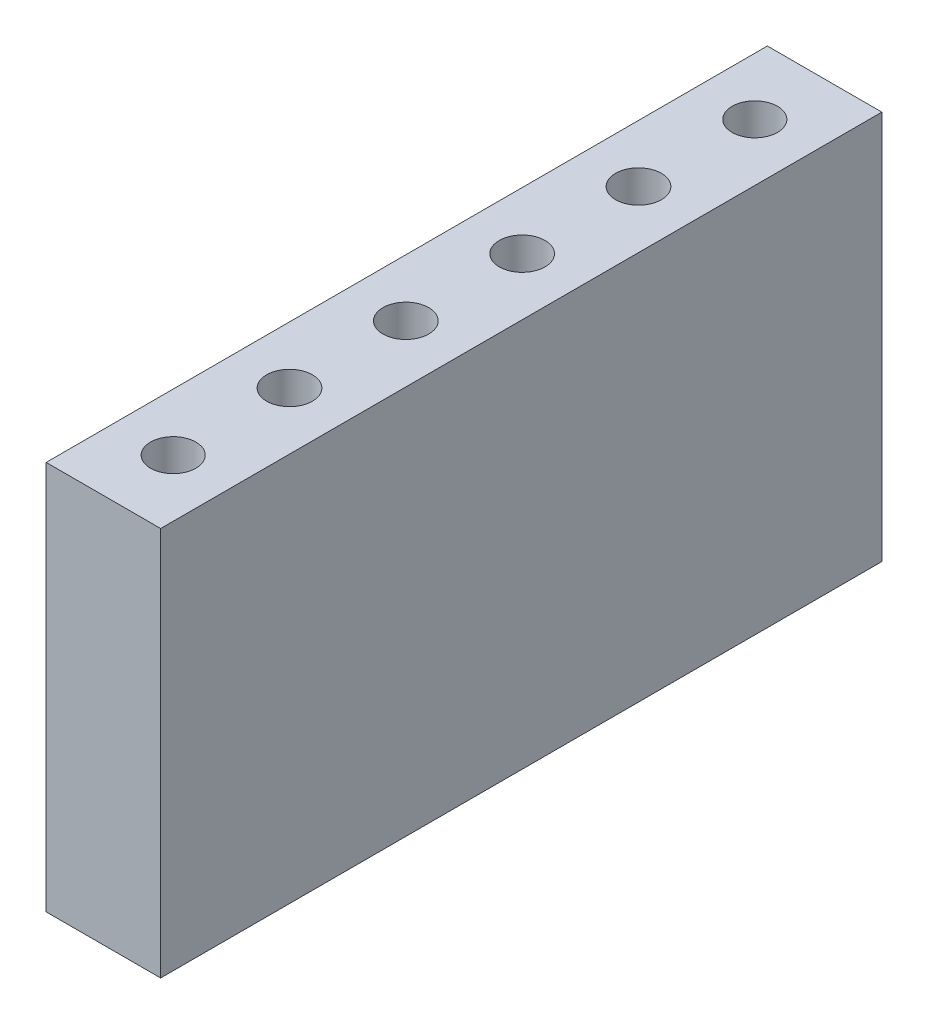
ISO-10303-21;
HEADER;
FILE_DESCRIPTION(('STEP AP214'),'2;1');
FILE_NAME('part.step','',(''),(''),'','','');
FILE_SCHEMA(('AUTOMOTIVE_DESIGN { 1 0 10303 214 1 1 1 1 }'));
ENDSEC;
DATA;
#1=APPLICATION_CONTEXT('core data for automotive mechanical design processes');
#2=APPLICATION_PROTOCOL_DEFINITION('international standard','automotive_design',2000,#1);
#3=PRODUCT_CONTEXT('',#1,'mechanical');
#4=PRODUCT('Part','Part','',(#3));
#5=PRODUCT_RELATED_PRODUCT_CATEGORY('part','',(#4));
#6=PRODUCT_DEFINITION_FORMATION('','',#4);
#7=PRODUCT_DEFINITION_CONTEXT('part definition',#1,'design');
#8=PRODUCT_DEFINITION('design','',#6,#7);
#9=PRODUCT_DEFINITION_SHAPE('','',#8);
#10=(LENGTH_UNIT() NAMED_UNIT(*) SI_UNIT(.MILLI.,.METRE.));
#11=(NAMED_UNIT(*) PLANE_ANGLE_UNIT() SI_UNIT($,.RADIAN.));
#12=(NAMED_UNIT(*) SI_UNIT($,.STERADIAN.) SOLID_ANGLE_UNIT());
#13=UNCERTAINTY_MEASURE_WITH_UNIT(LENGTH_MEASURE(1.E-05),#10,'distance_accuracy_value','');
#14=(GEOMETRIC_REPRESENTATION_CONTEXT(3) GLOBAL_UNCERTAINTY_ASSIGNED_CONTEXT((#13)) GLOBAL_UNIT_ASSIGNED_CONTEXT((#10,
#11,#12)) REPRESENTATION_CONTEXT('',''));
#15=CARTESIAN_POINT('',(0.,0.,0.));
#16=DIRECTION('',(0.,0.,1.));
#17=DIRECTION('',(1.,0.,0.));
#18=AXIS2_PLACEMENT_3D('',#15,#16,#17);
#19=CARTESIAN_POINT('',(0.,8.5,0.));
#20=DIRECTION('',(1.,0.,0.));
#21=DIRECTION('',(0.,0.,-1.));
#22=AXIS2_PLACEMENT_3D('',#19,#20,#21);
#23=PLANE('',#22);
#24=DIRECTION('',(0.,0.,1.));
#25=VECTOR('',#24,1.);
#26=CARTESIAN_POINT('',(0.,0.,0.));
#27=LINE('',#26,#25);
#28=CARTESIAN_POINT('',(0.,0.,-15.748));
#29=VERTEX_POINT('',#28);
#30=CARTESIAN_POINT('',(0.,0.,0.));
#31=VERTEX_POINT('',#30);
#32=EDGE_CURVE('E94',#29,#31,#27,.T.);
#33=ORIENTED_EDGE('',*,*,#32,.T.);
#34=DIRECTION('',(0.,-1.,0.));
#35=VECTOR('',#34,1.);
#36=CARTESIAN_POINT('',(0.,8.5,0.));
#37=LINE('',#36,#35);
#38=CARTESIAN_POINT('',(0.,8.5,0.));
#39=VERTEX_POINT('',#38);
#40=EDGE_CURVE('E11',#39,#31,#37,.T.);
#41=ORIENTED_EDGE('',*,*,#40,.F.);
#42=DIRECTION('',(0.,0.,1.));
#43=VECTOR('',#42,1.);
#44=CARTESIAN_POINT('',(0.,8.5,0.));
#45=LINE('',#44,#43);
#46=CARTESIAN_POINT('',(0.,8.5,-15.748));
#47=VERTEX_POINT('',#46);
#48=EDGE_CURVE('E82',#47,#39,#45,.T.);
#49=ORIENTED_EDGE('',*,*,#48,.F.);
#50=DIRECTION('',(0.,-1.,0.));
#51=VECTOR('',#50,1.);
#52=CARTESIAN_POINT('',(0.,8.5,-15.748));
#53=LINE('',#52,#51);
#54=EDGE_CURVE('E90',#47,#29,#53,.T.);
#55=ORIENTED_EDGE('',*,*,#54,.T.);
#56=EDGE_LOOP('',(#33,#41,#49,#55));
#57=FACE_BOUND('',#56,.T.);
#58=ADVANCED_FACE('F31',(#57),#23,.F.);
#59=CARTESIAN_POINT('',(0.,8.5,0.));
#60=DIRECTION('',(0.,0.,-1.));
#61=DIRECTION('',(-1.,0.,0.));
#62=AXIS2_PLACEMENT_3D('',#59,#60,#61);
#63=PLANE('',#62);
#64=DIRECTION('',(1.,0.,0.));
#65=VECTOR('',#64,1.);
#66=CARTESIAN_POINT('',(0.,0.,0.));
#67=LINE('',#66,#65);
#68=CARTESIAN_POINT('',(2.5,0.,0.));
#69=VERTEX_POINT('',#68);
#70=EDGE_CURVE('E86',#31,#69,#67,.T.);
#71=ORIENTED_EDGE('',*,*,#70,.T.);
#72=DIRECTION('',(0.,-1.,0.));
#73=VECTOR('',#72,1.);
#74=CARTESIAN_POINT('',(2.5,8.5,0.));
#75=LINE('',#74,#73);
#76=CARTESIAN_POINT('',(2.5,8.5,0.));
#77=VERTEX_POINT('',#76);
#78=EDGE_CURVE('E39',#77,#69,#75,.T.);
#79=ORIENTED_EDGE('',*,*,#78,.F.);
#80=DIRECTION('',(1.,0.,0.));
#81=VECTOR('',#80,1.);
#82=CARTESIAN_POINT('',(0.,8.5,0.));
#83=LINE('',#82,#81);
#84=EDGE_CURVE('E77',#39,#77,#83,.T.);
#85=ORIENTED_EDGE('',*,*,#84,.F.);
#86=ORIENTED_EDGE('',*,*,#40,.T.);
#87=EDGE_LOOP('',(#71,#79,#85,#86));
#88=FACE_BOUND('',#87,.T.);
#89=ADVANCED_FACE('F85',(#88),#63,.F.);
#90=CARTESIAN_POINT('',(2.5,8.5,0.));
#91=DIRECTION('',(-1.,0.,0.));
#92=DIRECTION('',(0.,0.,1.));
#93=AXIS2_PLACEMENT_3D('',#90,#91,#92);
#94=PLANE('',#93);
#95=DIRECTION('',(0.,0.,-1.));
#96=VECTOR('',#95,1.);
#97=CARTESIAN_POINT('',(2.5,0.,0.));
#98=LINE('',#97,#96);
#99=CARTESIAN_POINT('',(2.5,0.,-15.748));
#100=VERTEX_POINT('',#99);
#101=EDGE_CURVE('E64',#69,#100,#98,.T.);
#102=ORIENTED_EDGE('',*,*,#101,.T.);
#103=DIRECTION('',(0.,-1.,0.));
#104=VECTOR('',#103,1.);
#105=CARTESIAN_POINT('',(2.5,8.5,-15.748));
#106=LINE('',#105,#104);
#107=CARTESIAN_POINT('',(2.5,8.5,-15.748));
#108=VERTEX_POINT('',#107);
#109=EDGE_CURVE('E87',#108,#100,#106,.T.);
#110=ORIENTED_EDGE('',*,*,#109,.F.);
#111=DIRECTION('',(0.,0.,-1.));
#112=VECTOR('',#111,1.);
#113=CARTESIAN_POINT('',(2.5,8.5,0.));
#114=LINE('',#113,#112);
#115=EDGE_CURVE('E80',#77,#108,#114,.T.);
#116=ORIENTED_EDGE('',*,*,#115,.F.);
#117=ORIENTED_EDGE('',*,*,#78,.T.);
#118=EDGE_LOOP('',(#102,#110,#116,#117));
#119=FACE_BOUND('',#118,.T.);
#120=ADVANCED_FACE('F88',(#119),#94,.F.);
#121=CARTESIAN_POINT('',(0.,8.5,-15.748));
#122=DIRECTION('',(0.,0.,1.));
#123=DIRECTION('',(1.,0.,0.));
#124=AXIS2_PLACEMENT_3D('',#121,#122,#123);
#125=PLANE('',#124);
#126=DIRECTION('',(-1.,0.,0.));
#127=VECTOR('',#126,1.);
#128=CARTESIAN_POINT('',(0.,0.,-15.748));
#129=LINE('',#128,#127);
#130=EDGE_CURVE('E70',#100,#29,#129,.T.);
#131=ORIENTED_EDGE('',*,*,#130,.T.);
#132=ORIENTED_EDGE('',*,*,#54,.F.);
#133=DIRECTION('',(-1.,0.,0.));
#134=VECTOR('',#133,1.);
#135=CARTESIAN_POINT('',(0.,8.5,-15.748));
#136=LINE('',#135,#134);
#137=EDGE_CURVE('E47',#108,#47,#136,.T.);
#138=ORIENTED_EDGE('',*,*,#137,.F.);
#139=ORIENTED_EDGE('',*,*,#109,.T.);
#140=EDGE_LOOP('',(#131,#132,#138,#139));
#141=FACE_BOUND('',#140,.T.);
#142=ADVANCED_FACE('F102',(#141),#125,.F.);
#143=CARTESIAN_POINT('',(0.,8.5,-15.748));
#144=DIRECTION('',(0.,-1.,0.));
#145=DIRECTION('',(0.,0.,-1.));
#146=AXIS2_PLACEMENT_3D('',#143,#144,#145);
#147=PLANE('',#146);
#148=CARTESIAN_POINT('',(1.25,8.5,-9.144));
#149=DIRECTION('',(0.,1.,0.));
#150=DIRECTION('',(0.,0.,-1.));
#151=AXIS2_PLACEMENT_3D('',#148,#149,#150);
#152=CIRCLE('',#151,0.500000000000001);
#153=CARTESIAN_POINT('',(1.25,8.5,-9.644));
#154=VERTEX_POINT('',#153);
#155=EDGE_CURVE('E138',#154,#154,#152,.T.);
#156=ORIENTED_EDGE('',*,*,#155,.F.);
#157=EDGE_LOOP('',(#156));
#158=FACE_BOUND('',#157,.T.);
#159=CARTESIAN_POINT('',(1.25,8.5,-11.684));
#160=DIRECTION('',(0.,1.,0.));
#161=DIRECTION('',(0.,0.,-1.));
#162=AXIS2_PLACEMENT_3D('',#159,#160,#161);
#163=CIRCLE('',#162,0.500000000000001);
#164=CARTESIAN_POINT('',(1.25,8.5,-12.184));
#165=VERTEX_POINT('',#164);
#166=EDGE_CURVE('E132',#165,#165,#163,.T.);
#167=ORIENTED_EDGE('',*,*,#166,.F.);
#168=EDGE_LOOP('',(#167));
#169=FACE_BOUND('',#168,.T.);
#170=CARTESIAN_POINT('',(1.25,8.5,-14.224));
#171=DIRECTION('',(0.,1.,0.));
#172=DIRECTION('',(0.,0.,-1.));
#173=AXIS2_PLACEMENT_3D('',#170,#171,#172);
#174=CIRCLE('',#173,0.4953);
#175=CARTESIAN_POINT('',(1.25,8.5,-14.7193));
#176=VERTEX_POINT('',#175);
#177=EDGE_CURVE('E126',#176,#176,#174,.T.);
#178=ORIENTED_EDGE('',*,*,#177,.F.);
#179=EDGE_LOOP('',(#178));
#180=FACE_BOUND('',#179,.T.);
#181=CARTESIAN_POINT('',(1.25,8.5,-1.524));
#182=DIRECTION('',(0.,1.,0.));
#183=DIRECTION('',(0.,0.,1.));
#184=AXIS2_PLACEMENT_3D('',#181,#182,#183);
#185=CIRCLE('',#184,0.4953);
#186=CARTESIAN_POINT('',(1.25,8.5,-1.0287));
#187=VERTEX_POINT('',#186);
#188=EDGE_CURVE('E120',#187,#187,#185,.T.);
#189=ORIENTED_EDGE('',*,*,#188,.F.);
#190=EDGE_LOOP('',(#189));
#191=FACE_BOUND('',#190,.T.);
#192=CARTESIAN_POINT('',(1.25,8.5,-4.064));
#193=DIRECTION('',(0.,1.,0.));
#194=DIRECTION('',(0.,0.,1.));
#195=AXIS2_PLACEMENT_3D('',#192,#193,#194);
#196=CIRCLE('',#195,0.499999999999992);
#197=CARTESIAN_POINT('',(1.25,8.5,-3.56400000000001));
#198=VERTEX_POINT('',#197);
#199=EDGE_CURVE('E114',#198,#198,#196,.T.);
#200=ORIENTED_EDGE('',*,*,#199,.F.);
#201=EDGE_LOOP('',(#200));
#202=FACE_BOUND('',#201,.T.);
#203=CARTESIAN_POINT('',(1.25,8.5,-6.604));
#204=DIRECTION('',(0.,1.,0.));
#205=DIRECTION('',(0.,0.,1.));
#206=AXIS2_PLACEMENT_3D('',#203,#204,#205);
#207=CIRCLE('',#206,0.500000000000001);
#208=CARTESIAN_POINT('',(1.25,8.5,-6.104));
#209=VERTEX_POINT('',#208);
#210=EDGE_CURVE('E108',#209,#209,#207,.T.);
#211=ORIENTED_EDGE('',*,*,#210,.F.);
#212=EDGE_LOOP('',(#211));
#213=FACE_BOUND('',#212,.T.);
#214=ORIENTED_EDGE('',*,*,#48,.T.);
#215=ORIENTED_EDGE('',*,*,#84,.T.);
#216=ORIENTED_EDGE('',*,*,#115,.T.);
#217=ORIENTED_EDGE('',*,*,#137,.T.);
#218=EDGE_LOOP('',(#214,#215,#216,#217));
#219=FACE_BOUND('',#218,.T.);
#220=ADVANCED_FACE('F78',(#158,#169,#180,#191,#202,#213,#219),#147,.F.);
#221=CARTESIAN_POINT('',(0.,0.,-15.748));
#222=DIRECTION('',(0.,-1.,0.));
#223=DIRECTION('',(0.,0.,-1.));
#224=AXIS2_PLACEMENT_3D('',#221,#222,#223);
#225=PLANE('',#224);
#226=ORIENTED_EDGE('',*,*,#32,.F.);
#227=ORIENTED_EDGE('',*,*,#130,.F.);
#228=ORIENTED_EDGE('',*,*,#101,.F.);
#229=ORIENTED_EDGE('',*,*,#70,.F.);
#230=EDGE_LOOP('',(#226,#227,#228,#229));
#231=FACE_BOUND('',#230,.T.);
#232=ADVANCED_FACE('F105',(#231),#225,.T.);
#233=CARTESIAN_POINT('',(1.25,2.12,-6.604));
#234=DIRECTION('',(0.,1.,0.));
#235=DIRECTION('',(0.,0.,1.));
#236=AXIS2_PLACEMENT_3D('',#233,#234,#235);
#237=CYLINDRICAL_SURFACE('',#236,0.500000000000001);
#238=CARTESIAN_POINT('',(1.25,2.12,-6.604));
#239=DIRECTION('',(0.,1.,0.));
#240=DIRECTION('',(0.,0.,1.));
#241=AXIS2_PLACEMENT_3D('',#238,#239,#240);
#242=CIRCLE('',#241,0.500000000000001);
#243=CARTESIAN_POINT('',(1.25,2.12,-6.104));
#244=VERTEX_POINT('',#243);
#245=EDGE_CURVE('E97',#244,#244,#242,.T.);
#246=ORIENTED_EDGE('',*,*,#245,.F.);
#247=EDGE_LOOP('',(#246));
#248=FACE_BOUND('',#247,.T.);
#249=ORIENTED_EDGE('',*,*,#210,.T.);
#250=EDGE_LOOP('',(#249));
#251=FACE_BOUND('',#250,.T.);
#252=ADVANCED_FACE('F166',(#248,#251),#237,.F.);
#253=CARTESIAN_POINT('',(1.25,2.12,-6.604));
#254=DIRECTION('',(0.,1.,0.));
#255=DIRECTION('',(0.,0.,1.));
#256=AXIS2_PLACEMENT_3D('',#253,#254,#255);
#257=PLANE('',#256);
#258=ORIENTED_EDGE('',*,*,#245,.T.);
#259=EDGE_LOOP('',(#258));
#260=FACE_BOUND('',#259,.T.);
#261=ADVANCED_FACE('F168',(#260),#257,.T.);
#262=CARTESIAN_POINT('',(1.25,2.12,-4.064));
#263=DIRECTION('',(0.,1.,0.));
#264=DIRECTION('',(0.,0.,1.));
#265=AXIS2_PLACEMENT_3D('',#262,#263,#264);
#266=CYLINDRICAL_SURFACE('',#265,0.499999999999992);
#267=CARTESIAN_POINT('',(1.25,2.12,-4.064));
#268=DIRECTION('',(0.,1.,0.));
#269=DIRECTION('',(0.,0.,1.));
#270=AXIS2_PLACEMENT_3D('',#267,#268,#269);
#271=CIRCLE('',#270,0.499999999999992);
#272=CARTESIAN_POINT('',(1.25,2.12,-3.56400000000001));
#273=VERTEX_POINT('',#272);
#274=EDGE_CURVE('E111',#273,#273,#271,.T.);
#275=ORIENTED_EDGE('',*,*,#274,.F.);
#276=EDGE_LOOP('',(#275));
#277=FACE_BOUND('',#276,.T.);
#278=ORIENTED_EDGE('',*,*,#199,.T.);
#279=EDGE_LOOP('',(#278));
#280=FACE_BOUND('',#279,.T.);
#281=ADVANCED_FACE('F175',(#277,#280),#266,.F.);
#282=CARTESIAN_POINT('',(1.25,2.12,-4.064));
#283=DIRECTION('',(0.,1.,0.));
#284=DIRECTION('',(0.,0.,1.));
#285=AXIS2_PLACEMENT_3D('',#282,#283,#284);
#286=PLANE('',#285);
#287=ORIENTED_EDGE('',*,*,#274,.T.);
#288=EDGE_LOOP('',(#287));
#289=FACE_BOUND('',#288,.T.);
#290=ADVANCED_FACE('F223',(#289),#286,.T.);
#291=CARTESIAN_POINT('',(1.25,2.12,-1.524));
#292=DIRECTION('',(0.,1.,0.));
#293=DIRECTION('',(0.,0.,1.));
#294=AXIS2_PLACEMENT_3D('',#291,#292,#293);
#295=CYLINDRICAL_SURFACE('',#294,0.4953);
#296=CARTESIAN_POINT('',(1.25,2.12,-1.524));
#297=DIRECTION('',(0.,1.,0.));
#298=DIRECTION('',(0.,0.,1.));
#299=AXIS2_PLACEMENT_3D('',#296,#297,#298);
#300=CIRCLE('',#299,0.4953);
#301=CARTESIAN_POINT('',(1.25,2.12,-1.0287));
#302=VERTEX_POINT('',#301);
#303=EDGE_CURVE('E117',#302,#302,#300,.T.);
#304=ORIENTED_EDGE('',*,*,#303,.F.);
#305=EDGE_LOOP('',(#304));
#306=FACE_BOUND('',#305,.T.);
#307=ORIENTED_EDGE('',*,*,#188,.T.);
#308=EDGE_LOOP('',(#307));
#309=FACE_BOUND('',#308,.T.);
#310=ADVANCED_FACE('F232',(#306,#309),#295,.F.);
#311=CARTESIAN_POINT('',(1.25,2.12,-1.524));
#312=DIRECTION('',(0.,1.,0.));
#313=DIRECTION('',(0.,0.,1.));
#314=AXIS2_PLACEMENT_3D('',#311,#312,#313);
#315=PLANE('',#314);
#316=ORIENTED_EDGE('',*,*,#303,.T.);
#317=EDGE_LOOP('',(#316));
#318=FACE_BOUND('',#317,.T.);
#319=ADVANCED_FACE('F241',(#318),#315,.T.);
#320=CARTESIAN_POINT('',(1.25,2.12,-14.224));
#321=DIRECTION('',(0.,1.,0.));
#322=DIRECTION('',(0.,0.,1.));
#323=AXIS2_PLACEMENT_3D('',#320,#321,#322);
#324=CYLINDRICAL_SURFACE('',#323,0.4953);
#325=CARTESIAN_POINT('',(1.25,2.12,-14.224));
#326=DIRECTION('',(0.,1.,0.));
#327=DIRECTION('',(0.,0.,-1.));
#328=AXIS2_PLACEMENT_3D('',#325,#326,#327);
#329=CIRCLE('',#328,0.4953);
#330=CARTESIAN_POINT('',(1.25,2.12,-14.7193));
#331=VERTEX_POINT('',#330);
#332=EDGE_CURVE('E123',#331,#331,#329,.T.);
#333=ORIENTED_EDGE('',*,*,#332,.F.);
#334=EDGE_LOOP('',(#333));
#335=FACE_BOUND('',#334,.T.);
#336=ORIENTED_EDGE('',*,*,#177,.T.);
#337=EDGE_LOOP('',(#336));
#338=FACE_BOUND('',#337,.T.);
#339=ADVANCED_FACE('F250',(#335,#338),#324,.F.);
#340=CARTESIAN_POINT('',(1.25,2.12,-14.224));
#341=DIRECTION('',(0.,-1.,0.));
#342=DIRECTION('',(0.,0.,-1.));
#343=AXIS2_PLACEMENT_3D('',#340,#341,#342);
#344=PLANE('',#343);
#345=ORIENTED_EDGE('',*,*,#332,.T.);
#346=EDGE_LOOP('',(#345));
#347=FACE_BOUND('',#346,.T.);
#348=ADVANCED_FACE('F259',(#347),#344,.F.);
#349=CARTESIAN_POINT('',(1.25,2.12,-11.684));
#350=DIRECTION('',(0.,1.,0.));
#351=DIRECTION('',(0.,0.,1.));
#352=AXIS2_PLACEMENT_3D('',#349,#350,#351);
#353=CYLINDRICAL_SURFACE('',#352,0.500000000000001);
#354=CARTESIAN_POINT('',(1.25,2.12,-11.684));
#355=DIRECTION('',(0.,1.,0.));
#356=DIRECTION('',(0.,0.,-1.));
#357=AXIS2_PLACEMENT_3D('',#354,#355,#356);
#358=CIRCLE('',#357,0.500000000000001);
#359=CARTESIAN_POINT('',(1.25,2.12,-12.184));
#360=VERTEX_POINT('',#359);
#361=EDGE_CURVE('E129',#360,#360,#358,.T.);
#362=ORIENTED_EDGE('',*,*,#361,.F.);
#363=EDGE_LOOP('',(#362));
#364=FACE_BOUND('',#363,.T.);
#365=ORIENTED_EDGE('',*,*,#166,.T.);
#366=EDGE_LOOP('',(#365));
#367=FACE_BOUND('',#366,.T.);
#368=ADVANCED_FACE('F268',(#364,#367),#353,.F.);
#369=CARTESIAN_POINT('',(1.25,2.12,-11.684));
#370=DIRECTION('',(0.,-1.,0.));
#371=DIRECTION('',(0.,0.,-1.));
#372=AXIS2_PLACEMENT_3D('',#369,#370,#371);
#373=PLANE('',#372);
#374=ORIENTED_EDGE('',*,*,#361,.T.);
#375=EDGE_LOOP('',(#374));
#376=FACE_BOUND('',#375,.T.);
#377=ADVANCED_FACE('F149',(#376),#373,.F.);
#378=CARTESIAN_POINT('',(1.25,2.12,-9.144));
#379=DIRECTION('',(0.,1.,0.));
#380=DIRECTION('',(0.,0.,1.));
#381=AXIS2_PLACEMENT_3D('',#378,#379,#380);
#382=CYLINDRICAL_SURFACE('',#381,0.500000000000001);
#383=CARTESIAN_POINT('',(1.25,2.12,-9.144));
#384=DIRECTION('',(0.,1.,0.));
#385=DIRECTION('',(0.,0.,-1.));
#386=AXIS2_PLACEMENT_3D('',#383,#384,#385);
#387=CIRCLE('',#386,0.500000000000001);
#388=CARTESIAN_POINT('',(1.25,2.12,-9.644));
#389=VERTEX_POINT('',#388);
#390=EDGE_CURVE('E135',#389,#389,#387,.T.);
#391=ORIENTED_EDGE('',*,*,#390,.F.);
#392=EDGE_LOOP('',(#391));
#393=FACE_BOUND('',#392,.T.);
#394=ORIENTED_EDGE('',*,*,#155,.T.);
#395=EDGE_LOOP('',(#394));
#396=FACE_BOUND('',#395,.T.);
#397=ADVANCED_FACE('F146',(#393,#396),#382,.F.);
#398=CARTESIAN_POINT('',(1.25,2.12,-9.144));
#399=DIRECTION('',(0.,-1.,0.));
#400=DIRECTION('',(0.,0.,-1.));
#401=AXIS2_PLACEMENT_3D('',#398,#399,#400);
#402=PLANE('',#401);
#403=ORIENTED_EDGE('',*,*,#390,.T.);
#404=EDGE_LOOP('',(#403));
#405=FACE_BOUND('',#404,.T.);
#406=ADVANCED_FACE('F144',(#405),#402,.F.);
#407=CLOSED_SHELL('',(#58,#89,#120,#142,#220,#232,#252,#261,#281,#290,#310,#319,#339,#348,#368,
#377,#397,#406));
#408=MANIFOLD_SOLID_BREP('B2',#407);
#409=ADVANCED_BREP_SHAPE_REPRESENTATION('',(#18,#408),#14);
#410=SHAPE_DEFINITION_REPRESENTATION(#9,#409);
ENDSEC;
END-ISO-10303-21;
